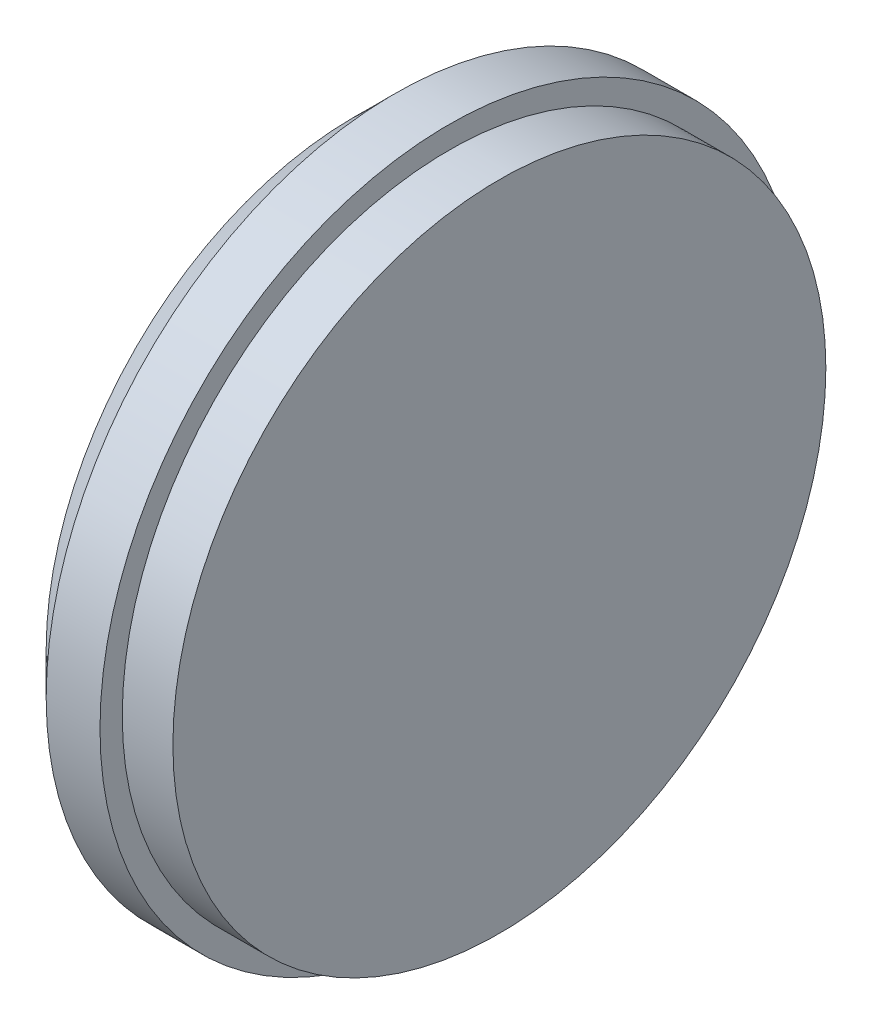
from build123d import *


with BuildPart() as part:
    # Sketch1 → Revolve1 (revolve)
    with BuildSketch(Plane.XY, mode=Mode.PRIVATE) as revolve1_sk:
        Polygon((-4.75996, 38.1), (-4.75996, -2.8448), (-11.10996, -2.8448), (-11.10996, -5.6388), (-17.85874, -5.6388), (-23.01748, -0.4826), (-23.01748, 38.1), align=None)
    revolve(revolve1_sk.sketch.rotate(Axis((-23.01748, 38.1, 0), (1, 0, 0)), 270), axis=Axis((-23.01748, 38.1, 0), (1, 0, 0)))


solid = part.part
